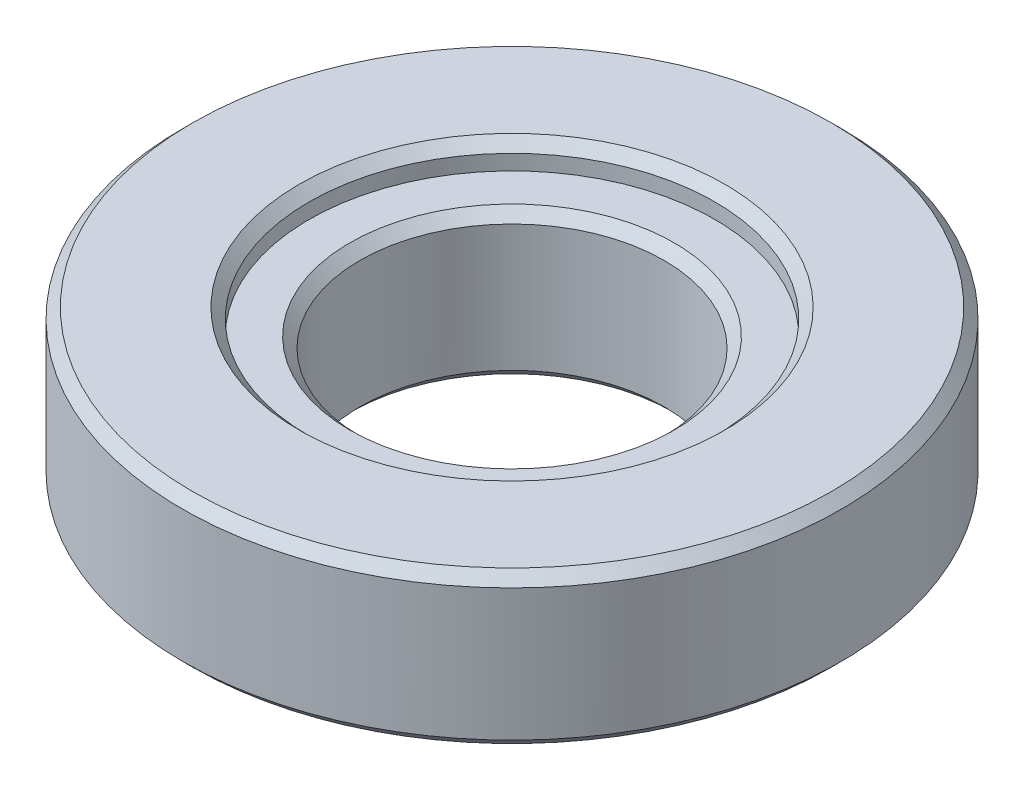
ISO-10303-21;
HEADER;
FILE_DESCRIPTION(('STEP AP214'),'2;1');
FILE_NAME('part.step','',(''),(''),'','','');
FILE_SCHEMA(('AUTOMOTIVE_DESIGN { 1 0 10303 214 1 1 1 1 }'));
ENDSEC;
DATA;
#1=APPLICATION_CONTEXT('core data for automotive mechanical design processes');
#2=APPLICATION_PROTOCOL_DEFINITION('international standard','automotive_design',2000,#1);
#3=PRODUCT_CONTEXT('',#1,'mechanical');
#4=PRODUCT('Part','Part','',(#3));
#5=PRODUCT_RELATED_PRODUCT_CATEGORY('part','',(#4));
#6=PRODUCT_DEFINITION_FORMATION('','',#4);
#7=PRODUCT_DEFINITION_CONTEXT('part definition',#1,'design');
#8=PRODUCT_DEFINITION('design','',#6,#7);
#9=PRODUCT_DEFINITION_SHAPE('','',#8);
#10=(LENGTH_UNIT() NAMED_UNIT(*) SI_UNIT(.MILLI.,.METRE.));
#11=(NAMED_UNIT(*) PLANE_ANGLE_UNIT() SI_UNIT($,.RADIAN.));
#12=(NAMED_UNIT(*) SI_UNIT($,.STERADIAN.) SOLID_ANGLE_UNIT());
#13=UNCERTAINTY_MEASURE_WITH_UNIT(LENGTH_MEASURE(1.E-05),#10,'distance_accuracy_value','');
#14=(GEOMETRIC_REPRESENTATION_CONTEXT(3) GLOBAL_UNCERTAINTY_ASSIGNED_CONTEXT((#13)) GLOBAL_UNIT_ASSIGNED_CONTEXT((#10,
#11,#12)) REPRESENTATION_CONTEXT('',''));
#15=CARTESIAN_POINT('',(0.,0.,0.));
#16=DIRECTION('',(0.,0.,1.));
#17=DIRECTION('',(1.,0.,0.));
#18=AXIS2_PLACEMENT_3D('',#15,#16,#17);
#19=CARTESIAN_POINT('',(0.,2.5,0.));
#20=DIRECTION('',(0.,1.,0.));
#21=DIRECTION('',(0.,0.,1.));
#22=AXIS2_PLACEMENT_3D('',#19,#20,#21);
#23=CYLINDRICAL_SURFACE('',#22,4.);
#24=CARTESIAN_POINT('',(0.,2.5,0.));
#25=DIRECTION('',(0.,1.,0.));
#26=DIRECTION('',(0.,0.,1.));
#27=AXIS2_PLACEMENT_3D('',#24,#25,#26);
#28=CIRCLE('',#27,4.);
#29=CARTESIAN_POINT('',(0.,2.5,4.));
#30=VERTEX_POINT('',#29);
#31=EDGE_CURVE('E18',#30,#30,#28,.T.);
#32=ORIENTED_EDGE('',*,*,#31,.F.);
#33=EDGE_LOOP('',(#32));
#34=FACE_BOUND('',#33,.T.);
#35=CARTESIAN_POINT('',(0.,2.79999999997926,0.));
#36=DIRECTION('',(0.,1.,0.));
#37=DIRECTION('',(0.,0.,1.));
#38=AXIS2_PLACEMENT_3D('',#35,#36,#37);
#39=CIRCLE('',#38,4.0000000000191);
#40=CARTESIAN_POINT('',(0.,2.79999999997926,4.0000000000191));
#41=VERTEX_POINT('',#40);
#42=EDGE_CURVE('E30',#41,#41,#39,.T.);
#43=ORIENTED_EDGE('',*,*,#42,.T.);
#44=EDGE_LOOP('',(#43));
#45=FACE_BOUND('',#44,.T.);
#46=ADVANCED_FACE('F15',(#34,#45),#23,.F.);
#47=CARTESIAN_POINT('',(0.,2.5,0.));
#48=DIRECTION('',(0.,1.,0.));
#49=DIRECTION('',(0.,0.,1.));
#50=AXIS2_PLACEMENT_3D('',#47,#48,#49);
#51=PLANE('',#50);
#52=ORIENTED_EDGE('',*,*,#31,.T.);
#53=EDGE_LOOP('',(#52));
#54=FACE_BOUND('',#53,.T.);
#55=CARTESIAN_POINT('',(0.,2.49999999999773,0.));
#56=DIRECTION('',(0.,1.,0.));
#57=DIRECTION('',(0.,0.,1.));
#58=AXIS2_PLACEMENT_3D('',#55,#56,#57);
#59=CIRCLE('',#58,3.1999999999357);
#60=CARTESIAN_POINT('',(0.,2.49999999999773,3.1999999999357));
#61=VERTEX_POINT('',#60);
#62=EDGE_CURVE('E47',#61,#61,#59,.F.);
#63=ORIENTED_EDGE('',*,*,#62,.T.);
#64=EDGE_LOOP('',(#63));
#65=FACE_BOUND('',#64,.T.);
#66=ADVANCED_FACE('F57',(#54,#65),#51,.T.);
#67=CARTESIAN_POINT('',(0.,3.00000000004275,0.));
#68=DIRECTION('',(0.,1.,0.));
#69=DIRECTION('',(-1.,0.,0.));
#70=AXIS2_PLACEMENT_3D('',#67,#68,#69);
#71=CONICAL_SURFACE('',#70,4.20000000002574,0.78539816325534);
#72=ORIENTED_EDGE('',*,*,#42,.F.);
#73=EDGE_LOOP('',(#72));
#74=FACE_BOUND('',#73,.T.);
#75=CARTESIAN_POINT('',(0.,3.00000000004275,0.));
#76=DIRECTION('',(0.,1.,0.));
#77=DIRECTION('',(-1.,0.,0.));
#78=AXIS2_PLACEMENT_3D('',#75,#76,#77);
#79=CIRCLE('',#78,4.20000000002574);
#80=CARTESIAN_POINT('',(-4.20000000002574,3.00000000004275,0.));
#81=VERTEX_POINT('',#80);
#82=EDGE_CURVE('E45',#81,#81,#79,.F.);
#83=ORIENTED_EDGE('',*,*,#82,.F.);
#84=EDGE_LOOP('',(#83));
#85=FACE_BOUND('',#84,.T.);
#86=ADVANCED_FACE('F64',(#74,#85),#71,.F.);
#87=CARTESIAN_POINT('',(0.,2.49999999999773,0.));
#88=DIRECTION('',(0.,1.,0.));
#89=DIRECTION('',(0.,0.,1.));
#90=AXIS2_PLACEMENT_3D('',#87,#88,#89);
#91=CONICAL_SURFACE('',#90,3.1999999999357,0.78539816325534);
#92=CARTESIAN_POINT('',(0.,2.3,0.));
#93=DIRECTION('',(0.,-1.,0.));
#94=DIRECTION('',(0.,0.,-1.));
#95=AXIS2_PLACEMENT_3D('',#92,#93,#94);
#96=CIRCLE('',#95,3.);
#97=CARTESIAN_POINT('',(0.,2.3,-3.));
#98=VERTEX_POINT('',#97);
#99=EDGE_CURVE('E44',#98,#98,#96,.T.);
#100=ORIENTED_EDGE('',*,*,#99,.T.);
#101=EDGE_LOOP('',(#100));
#102=FACE_BOUND('',#101,.T.);
#103=ORIENTED_EDGE('',*,*,#62,.F.);
#104=EDGE_LOOP('',(#103));
#105=FACE_BOUND('',#104,.T.);
#106=ADVANCED_FACE('F103',(#102,#105),#91,.F.);
#107=CARTESIAN_POINT('',(0.,3.,0.));
#108=DIRECTION('',(0.,1.,0.));
#109=DIRECTION('',(0.,0.,1.));
#110=AXIS2_PLACEMENT_3D('',#107,#108,#109);
#111=PLANE('',#110);
#112=ORIENTED_EDGE('',*,*,#82,.T.);
#113=EDGE_LOOP('',(#112));
#114=FACE_BOUND('',#113,.T.);
#115=CARTESIAN_POINT('',(0.,2.9999999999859,0.));
#116=DIRECTION('',(0.,-1.,0.));
#117=DIRECTION('',(0.,0.,-1.));
#118=AXIS2_PLACEMENT_3D('',#115,#116,#117);
#119=CIRCLE('',#118,6.29999999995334);
#120=CARTESIAN_POINT('',(0.,2.9999999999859,-6.29999999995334));
#121=VERTEX_POINT('',#120);
#122=EDGE_CURVE('E40',#121,#121,#119,.T.);
#123=ORIENTED_EDGE('',*,*,#122,.F.);
#124=EDGE_LOOP('',(#123));
#125=FACE_BOUND('',#124,.T.);
#126=ADVANCED_FACE('F99',(#114,#125),#111,.T.);
#127=CARTESIAN_POINT('',(0.,3.,0.));
#128=DIRECTION('',(0.,-1.,0.));
#129=DIRECTION('',(0.,0.,-1.));
#130=AXIS2_PLACEMENT_3D('',#127,#128,#129);
#131=CYLINDRICAL_SURFACE('',#130,3.);
#132=ORIENTED_EDGE('',*,*,#99,.F.);
#133=EDGE_LOOP('',(#132));
#134=FACE_BOUND('',#133,.T.);
#135=CARTESIAN_POINT('',(0.,-0.199999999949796,0.));
#136=DIRECTION('',(0.,-1.,0.));
#137=DIRECTION('',(0.,0.,-1.));
#138=AXIS2_PLACEMENT_3D('',#135,#136,#137);
#139=CIRCLE('',#138,2.9999999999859);
#140=CARTESIAN_POINT('',(0.,-0.199999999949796,-2.9999999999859));
#141=VERTEX_POINT('',#140);
#142=EDGE_CURVE('E43',#141,#141,#139,.T.);
#143=ORIENTED_EDGE('',*,*,#142,.T.);
#144=EDGE_LOOP('',(#143));
#145=FACE_BOUND('',#144,.T.);
#146=ADVANCED_FACE('F95',(#134,#145),#131,.F.);
#147=CARTESIAN_POINT('',(0.,2.80000000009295,0.));
#148=DIRECTION('',(0.,-1.,0.));
#149=DIRECTION('',(0.,0.,-1.));
#150=AXIS2_PLACEMENT_3D('',#147,#148,#149);
#151=CONICAL_SURFACE('',#150,6.49999999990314,0.785398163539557);
#152=ORIENTED_EDGE('',*,*,#122,.T.);
#153=EDGE_LOOP('',(#152));
#154=FACE_BOUND('',#153,.T.);
#155=CARTESIAN_POINT('',(0.,2.8,0.));
#156=DIRECTION('',(0.,-1.,0.));
#157=DIRECTION('',(0.,0.,-1.));
#158=AXIS2_PLACEMENT_3D('',#155,#156,#157);
#159=CIRCLE('',#158,6.5);
#160=CARTESIAN_POINT('',(0.,2.8,-6.5));
#161=VERTEX_POINT('',#160);
#162=EDGE_CURVE('E39',#161,#161,#159,.T.);
#163=ORIENTED_EDGE('',*,*,#162,.F.);
#164=EDGE_LOOP('',(#163));
#165=FACE_BOUND('',#164,.T.);
#166=ADVANCED_FACE('F91',(#154,#165),#151,.T.);
#167=CARTESIAN_POINT('',(0.,-0.400000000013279,0.));
#168=DIRECTION('',(0.,-1.,0.));
#169=DIRECTION('',(0.,0.,-1.));
#170=AXIS2_PLACEMENT_3D('',#167,#168,#169);
#171=CONICAL_SURFACE('',#170,3.19999999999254,0.78539816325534);
#172=ORIENTED_EDGE('',*,*,#142,.F.);
#173=EDGE_LOOP('',(#172));
#174=FACE_BOUND('',#173,.T.);
#175=CARTESIAN_POINT('',(0.,-0.400000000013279,0.));
#176=DIRECTION('',(0.,-1.,0.));
#177=DIRECTION('',(0.,0.,-1.));
#178=AXIS2_PLACEMENT_3D('',#175,#176,#177);
#179=CIRCLE('',#178,3.19999999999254);
#180=CARTESIAN_POINT('',(0.,-0.400000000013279,-3.19999999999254));
#181=VERTEX_POINT('',#180);
#182=EDGE_CURVE('E36',#181,#181,#179,.F.);
#183=ORIENTED_EDGE('',*,*,#182,.F.);
#184=EDGE_LOOP('',(#183));
#185=FACE_BOUND('',#184,.T.);
#186=ADVANCED_FACE('F87',(#174,#185),#171,.F.);
#187=CARTESIAN_POINT('',(0.,3.,0.));
#188=DIRECTION('',(0.,-1.,0.));
#189=DIRECTION('',(0.,0.,-1.));
#190=AXIS2_PLACEMENT_3D('',#187,#188,#189);
#191=CYLINDRICAL_SURFACE('',#190,6.5);
#192=ORIENTED_EDGE('',*,*,#162,.T.);
#193=EDGE_LOOP('',(#192));
#194=FACE_BOUND('',#193,.T.);
#195=CARTESIAN_POINT('',(0.,0.199999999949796,0.));
#196=DIRECTION('',(0.,1.,0.));
#197=DIRECTION('',(0.,0.,1.));
#198=AXIS2_PLACEMENT_3D('',#195,#196,#197);
#199=CIRCLE('',#198,6.50000000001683);
#200=CARTESIAN_POINT('',(0.,0.199999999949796,6.50000000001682));
#201=VERTEX_POINT('',#200);
#202=EDGE_CURVE('E35',#201,#201,#199,.F.);
#203=ORIENTED_EDGE('',*,*,#202,.F.);
#204=EDGE_LOOP('',(#203));
#205=FACE_BOUND('',#204,.T.);
#206=ADVANCED_FACE('F83',(#194,#205),#191,.T.);
#207=CARTESIAN_POINT('',(0.,-0.4,0.));
#208=DIRECTION('',(0.,-1.,0.));
#209=DIRECTION('',(0.,0.,-1.));
#210=AXIS2_PLACEMENT_3D('',#207,#208,#209);
#211=PLANE('',#210);
#212=CARTESIAN_POINT('',(0.,-0.399999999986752,0.));
#213=DIRECTION('',(0.,1.,0.));
#214=DIRECTION('',(0.,0.,1.));
#215=AXIS2_PLACEMENT_3D('',#212,#213,#214);
#216=CIRCLE('',#215,3.39999999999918);
#217=CARTESIAN_POINT('',(0.,-0.399999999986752,3.39999999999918));
#218=VERTEX_POINT('',#217);
#219=EDGE_CURVE('E27',#218,#218,#216,.T.);
#220=ORIENTED_EDGE('',*,*,#219,.F.);
#221=EDGE_LOOP('',(#220));
#222=FACE_BOUND('',#221,.T.);
#223=ORIENTED_EDGE('',*,*,#182,.T.);
#224=EDGE_LOOP('',(#223));
#225=FACE_BOUND('',#224,.T.);
#226=ADVANCED_FACE('F79',(#222,#225),#211,.T.);
#227=CARTESIAN_POINT('',(0.,0.199999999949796,0.));
#228=DIRECTION('',(0.,1.,0.));
#229=DIRECTION('',(-1.,0.,0.));
#230=AXIS2_PLACEMENT_3D('',#227,#228,#229);
#231=CONICAL_SURFACE('',#230,6.50000000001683,0.785398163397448);
#232=CARTESIAN_POINT('',(0.,0.,0.));
#233=DIRECTION('',(0.,1.,0.));
#234=DIRECTION('',(-1.,0.,0.));
#235=AXIS2_PLACEMENT_3D('',#232,#233,#234);
#236=CIRCLE('',#235,6.30000000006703);
#237=CARTESIAN_POINT('',(-6.30000000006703,0.,0.));
#238=VERTEX_POINT('',#237);
#239=EDGE_CURVE('E22',#238,#238,#236,.T.);
#240=ORIENTED_EDGE('',*,*,#239,.T.);
#241=EDGE_LOOP('',(#240));
#242=FACE_BOUND('',#241,.T.);
#243=ORIENTED_EDGE('',*,*,#202,.T.);
#244=EDGE_LOOP('',(#243));
#245=FACE_BOUND('',#244,.T.);
#246=ADVANCED_FACE('F73',(#242,#245),#231,.T.);
#247=CARTESIAN_POINT('',(0.,0.,0.));
#248=DIRECTION('',(0.,1.,0.));
#249=DIRECTION('',(0.,0.,1.));
#250=AXIS2_PLACEMENT_3D('',#247,#248,#249);
#251=CONICAL_SURFACE('',#250,4.14999999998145,1.0808390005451);
#252=CARTESIAN_POINT('',(0.,0.,0.));
#253=DIRECTION('',(0.,1.,0.));
#254=DIRECTION('',(0.,0.,1.));
#255=AXIS2_PLACEMENT_3D('',#252,#253,#254);
#256=CIRCLE('',#255,4.14999999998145);
#257=CARTESIAN_POINT('',(0.,0.,4.14999999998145));
#258=VERTEX_POINT('',#257);
#259=EDGE_CURVE('E10',#258,#258,#256,.F.);
#260=ORIENTED_EDGE('',*,*,#259,.T.);
#261=EDGE_LOOP('',(#260));
#262=FACE_BOUND('',#261,.T.);
#263=ORIENTED_EDGE('',*,*,#219,.T.);
#264=EDGE_LOOP('',(#263));
#265=FACE_BOUND('',#264,.T.);
#266=ADVANCED_FACE('F67',(#262,#265),#251,.T.);
#267=CARTESIAN_POINT('',(0.,0.,0.));
#268=DIRECTION('',(0.,1.,0.));
#269=DIRECTION('',(0.,0.,1.));
#270=AXIS2_PLACEMENT_3D('',#267,#268,#269);
#271=PLANE('',#270);
#272=ORIENTED_EDGE('',*,*,#259,.F.);
#273=EDGE_LOOP('',(#272));
#274=FACE_BOUND('',#273,.T.);
#275=ORIENTED_EDGE('',*,*,#239,.F.);
#276=EDGE_LOOP('',(#275));
#277=FACE_BOUND('',#276,.T.);
#278=ADVANCED_FACE('F65',(#274,#277),#271,.F.);
#279=CLOSED_SHELL('',(#46,#66,#86,#106,#126,#146,#166,#186,#206,#226,#246,#266,#278));
#280=MANIFOLD_SOLID_BREP('B1',#279);
#281=ADVANCED_BREP_SHAPE_REPRESENTATION('',(#18,#280),#14);
#282=SHAPE_DEFINITION_REPRESENTATION(#9,#281);
ENDSEC;
END-ISO-10303-21;
